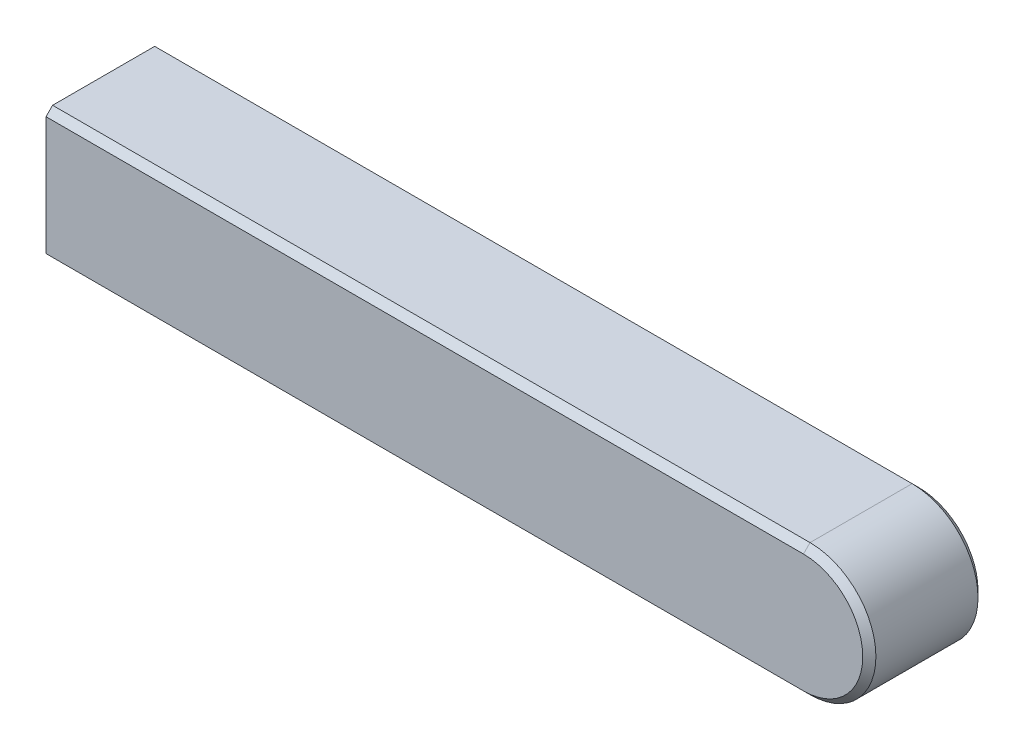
ISO-10303-21;
HEADER;
FILE_DESCRIPTION(('STEP AP214'),'2;1');
FILE_NAME('part.step','',(''),(''),'','','');
FILE_SCHEMA(('AUTOMOTIVE_DESIGN { 1 0 10303 214 1 1 1 1 }'));
ENDSEC;
DATA;
#1=APPLICATION_CONTEXT('core data for automotive mechanical design processes');
#2=APPLICATION_PROTOCOL_DEFINITION('international standard','automotive_design',2000,#1);
#3=PRODUCT_CONTEXT('',#1,'mechanical');
#4=PRODUCT('Part','Part','',(#3));
#5=PRODUCT_RELATED_PRODUCT_CATEGORY('part','',(#4));
#6=PRODUCT_DEFINITION_FORMATION('','',#4);
#7=PRODUCT_DEFINITION_CONTEXT('part definition',#1,'design');
#8=PRODUCT_DEFINITION('design','',#6,#7);
#9=PRODUCT_DEFINITION_SHAPE('','',#8);
#10=(LENGTH_UNIT() NAMED_UNIT(*) SI_UNIT(.MILLI.,.METRE.));
#11=(NAMED_UNIT(*) PLANE_ANGLE_UNIT() SI_UNIT($,.RADIAN.));
#12=(NAMED_UNIT(*) SI_UNIT($,.STERADIAN.) SOLID_ANGLE_UNIT());
#13=UNCERTAINTY_MEASURE_WITH_UNIT(LENGTH_MEASURE(1.E-05),#10,'distance_accuracy_value','');
#14=(GEOMETRIC_REPRESENTATION_CONTEXT(3) GLOBAL_UNCERTAINTY_ASSIGNED_CONTEXT((#13)) GLOBAL_UNIT_ASSIGNED_CONTEXT((#10,
#11,#12)) REPRESENTATION_CONTEXT('',''));
#15=CARTESIAN_POINT('',(0.,0.,0.));
#16=DIRECTION('',(0.,0.,1.));
#17=DIRECTION('',(1.,0.,0.));
#18=AXIS2_PLACEMENT_3D('',#15,#16,#17);
#19=CARTESIAN_POINT('',(0.,0.,7.));
#20=DIRECTION('',(1.,0.,0.));
#21=DIRECTION('',(0.,0.,-1.));
#22=AXIS2_PLACEMENT_3D('',#19,#20,#21);
#23=PLANE('',#22);
#24=DIRECTION('',(0.,-1.,0.));
#25=VECTOR('',#24,1.);
#26=CARTESIAN_POINT('',(0.,0.,0.));
#27=LINE('',#26,#25);
#28=CARTESIAN_POINT('',(0.,7.6,0.));
#29=VERTEX_POINT('',#28);
#30=CARTESIAN_POINT('',(0.,0.399999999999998,0.));
#31=VERTEX_POINT('',#30);
#32=EDGE_CURVE('E133',#29,#31,#27,.T.);
#33=ORIENTED_EDGE('',*,*,#32,.T.);
#34=DIRECTION('',(0.,-0.707106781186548,0.707106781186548));
#35=VECTOR('',#34,1.);
#36=CARTESIAN_POINT('',(0.,0.,0.399999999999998));
#37=LINE('',#36,#35);
#38=CARTESIAN_POINT('',(0.,0.,0.4));
#39=VERTEX_POINT('',#38);
#40=EDGE_CURVE('E111',#31,#39,#37,.T.);
#41=ORIENTED_EDGE('',*,*,#40,.T.);
#42=DIRECTION('',(0.,0.,-1.));
#43=VECTOR('',#42,1.);
#44=CARTESIAN_POINT('',(0.,0.,7.));
#45=LINE('',#44,#43);
#46=CARTESIAN_POINT('',(0.,0.,6.6));
#47=VERTEX_POINT('',#46);
#48=EDGE_CURVE('E121',#47,#39,#45,.T.);
#49=ORIENTED_EDGE('',*,*,#48,.F.);
#50=DIRECTION('',(0.,-0.707106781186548,-0.707106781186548));
#51=VECTOR('',#50,1.);
#52=CARTESIAN_POINT('',(0.,0.399999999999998,7.));
#53=LINE('',#52,#51);
#54=CARTESIAN_POINT('',(0.,0.399999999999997,7.));
#55=VERTEX_POINT('',#54);
#56=EDGE_CURVE('E125',#47,#55,#53,.F.);
#57=ORIENTED_EDGE('',*,*,#56,.T.);
#58=DIRECTION('',(0.,-1.,0.));
#59=VECTOR('',#58,1.);
#60=CARTESIAN_POINT('',(0.,0.,7.));
#61=LINE('',#60,#59);
#62=CARTESIAN_POINT('',(0.,7.6,7.));
#63=VERTEX_POINT('',#62);
#64=EDGE_CURVE('E161',#63,#55,#61,.T.);
#65=ORIENTED_EDGE('',*,*,#64,.F.);
#66=DIRECTION('',(0.,-0.707106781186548,0.707106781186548));
#67=VECTOR('',#66,1.);
#68=CARTESIAN_POINT('',(0.,7.6,7.));
#69=LINE('',#68,#67);
#70=CARTESIAN_POINT('',(0.,8.,6.6));
#71=VERTEX_POINT('',#70);
#72=EDGE_CURVE('E147',#63,#71,#69,.F.);
#73=ORIENTED_EDGE('',*,*,#72,.T.);
#74=DIRECTION('',(0.,0.,-1.));
#75=VECTOR('',#74,1.);
#76=CARTESIAN_POINT('',(0.,8.,7.));
#77=LINE('',#76,#75);
#78=CARTESIAN_POINT('',(0.,8.,0.4));
#79=VERTEX_POINT('',#78);
#80=EDGE_CURVE('E158',#71,#79,#77,.T.);
#81=ORIENTED_EDGE('',*,*,#80,.T.);
#82=DIRECTION('',(0.,-0.707106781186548,-0.707106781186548));
#83=VECTOR('',#82,1.);
#84=CARTESIAN_POINT('',(0.,8.,0.399999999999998));
#85=LINE('',#84,#83);
#86=EDGE_CURVE('E144',#79,#29,#85,.T.);
#87=ORIENTED_EDGE('',*,*,#86,.T.);
#88=EDGE_LOOP('',(#33,#41,#49,#57,#65,#73,#81,#87));
#89=FACE_BOUND('',#88,.T.);
#90=ADVANCED_FACE('F33',(#89),#23,.F.);
#91=CARTESIAN_POINT('',(0.,0.,7.));
#92=DIRECTION('',(0.,1.,0.));
#93=DIRECTION('',(0.,0.,1.));
#94=AXIS2_PLACEMENT_3D('',#91,#92,#93);
#95=PLANE('',#94);
#96=ORIENTED_EDGE('',*,*,#48,.T.);
#97=DIRECTION('',(1.,0.,0.));
#98=VECTOR('',#97,1.);
#99=CARTESIAN_POINT('',(46.,0.,0.399999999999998));
#100=LINE('',#99,#98);
#101=CARTESIAN_POINT('',(46.,0.,0.399999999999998));
#102=VERTEX_POINT('',#101);
#103=EDGE_CURVE('E120',#39,#102,#100,.T.);
#104=ORIENTED_EDGE('',*,*,#103,.T.);
#105=DIRECTION('',(0.,0.,-1.));
#106=VECTOR('',#105,1.);
#107=CARTESIAN_POINT('',(46.,0.,7.));
#108=LINE('',#107,#106);
#109=CARTESIAN_POINT('',(46.,0.,6.6));
#110=VERTEX_POINT('',#109);
#111=EDGE_CURVE('E104',#110,#102,#108,.T.);
#112=ORIENTED_EDGE('',*,*,#111,.F.);
#113=DIRECTION('',(-1.,0.,0.));
#114=VECTOR('',#113,1.);
#115=CARTESIAN_POINT('',(0.,0.,6.6));
#116=LINE('',#115,#114);
#117=EDGE_CURVE('E117',#110,#47,#116,.T.);
#118=ORIENTED_EDGE('',*,*,#117,.T.);
#119=EDGE_LOOP('',(#96,#104,#112,#118));
#120=FACE_BOUND('',#119,.T.);
#121=ADVANCED_FACE('F116',(#120),#95,.F.);
#122=CARTESIAN_POINT('',(46.,4.,7.));
#123=DIRECTION('',(0.,0.,-1.));
#124=DIRECTION('',(-1.,0.,0.));
#125=AXIS2_PLACEMENT_3D('',#122,#123,#124);
#126=CYLINDRICAL_SURFACE('',#125,4.);
#127=ORIENTED_EDGE('',*,*,#111,.T.);
#128=CARTESIAN_POINT('',(46.,4.,0.399999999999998));
#129=DIRECTION('',(0.,0.,-1.));
#130=DIRECTION('',(-1.,0.,0.));
#131=AXIS2_PLACEMENT_3D('',#128,#129,#130);
#132=CIRCLE('',#131,4.);
#133=CARTESIAN_POINT('',(46.,8.,0.399999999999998));
#134=VERTEX_POINT('',#133);
#135=EDGE_CURVE('E110',#102,#134,#132,.F.);
#136=ORIENTED_EDGE('',*,*,#135,.T.);
#137=DIRECTION('',(0.,0.,-1.));
#138=VECTOR('',#137,1.);
#139=CARTESIAN_POINT('',(46.,8.,7.));
#140=LINE('',#139,#138);
#141=CARTESIAN_POINT('',(46.,8.,6.6));
#142=VERTEX_POINT('',#141);
#143=EDGE_CURVE('E106',#142,#134,#140,.T.);
#144=ORIENTED_EDGE('',*,*,#143,.F.);
#145=CARTESIAN_POINT('',(46.,4.,6.6));
#146=DIRECTION('',(0.,0.,-1.));
#147=DIRECTION('',(-1.,0.,0.));
#148=AXIS2_PLACEMENT_3D('',#145,#146,#147);
#149=CIRCLE('',#148,4.);
#150=EDGE_CURVE('E101',#142,#110,#149,.T.);
#151=ORIENTED_EDGE('',*,*,#150,.T.);
#152=EDGE_LOOP('',(#127,#136,#144,#151));
#153=FACE_BOUND('',#152,.T.);
#154=ADVANCED_FACE('F103',(#153),#126,.T.);
#155=CARTESIAN_POINT('',(0.,8.,7.));
#156=DIRECTION('',(0.,-1.,0.));
#157=DIRECTION('',(0.,0.,-1.));
#158=AXIS2_PLACEMENT_3D('',#155,#156,#157);
#159=PLANE('',#158);
#160=ORIENTED_EDGE('',*,*,#143,.T.);
#161=DIRECTION('',(-1.,0.,0.));
#162=VECTOR('',#161,1.);
#163=CARTESIAN_POINT('',(0.,8.,0.399999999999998));
#164=LINE('',#163,#162);
#165=EDGE_CURVE('E138',#134,#79,#164,.T.);
#166=ORIENTED_EDGE('',*,*,#165,.T.);
#167=ORIENTED_EDGE('',*,*,#80,.F.);
#168=DIRECTION('',(1.,0.,0.));
#169=VECTOR('',#168,1.);
#170=CARTESIAN_POINT('',(0.,8.,6.6));
#171=LINE('',#170,#169);
#172=EDGE_CURVE('E140',#71,#142,#171,.T.);
#173=ORIENTED_EDGE('',*,*,#172,.T.);
#174=EDGE_LOOP('',(#160,#166,#167,#173));
#175=FACE_BOUND('',#174,.T.);
#176=ADVANCED_FACE('F173',(#175),#159,.F.);
#177=CARTESIAN_POINT('',(46.,4.,7.));
#178=DIRECTION('',(0.,0.,-1.));
#179=DIRECTION('',(-1.,0.,0.));
#180=AXIS2_PLACEMENT_3D('',#177,#178,#179);
#181=PLANE('',#180);
#182=ORIENTED_EDGE('',*,*,#64,.T.);
#183=DIRECTION('',(1.,0.,0.));
#184=VECTOR('',#183,1.);
#185=CARTESIAN_POINT('',(46.,0.399999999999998,7.));
#186=LINE('',#185,#184);
#187=CARTESIAN_POINT('',(46.,0.399999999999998,7.));
#188=VERTEX_POINT('',#187);
#189=EDGE_CURVE('E11',#55,#188,#186,.T.);
#190=ORIENTED_EDGE('',*,*,#189,.T.);
#191=CARTESIAN_POINT('',(46.,4.,7.));
#192=DIRECTION('',(0.,0.,-1.));
#193=DIRECTION('',(-1.,0.,0.));
#194=AXIS2_PLACEMENT_3D('',#191,#192,#193);
#195=CIRCLE('',#194,3.6);
#196=CARTESIAN_POINT('',(46.,7.6,7.));
#197=VERTEX_POINT('',#196);
#198=EDGE_CURVE('E42',#188,#197,#195,.F.);
#199=ORIENTED_EDGE('',*,*,#198,.T.);
#200=DIRECTION('',(-1.,0.,0.));
#201=VECTOR('',#200,1.);
#202=CARTESIAN_POINT('',(46.,7.6,7.));
#203=LINE('',#202,#201);
#204=EDGE_CURVE('E136',#197,#63,#203,.T.);
#205=ORIENTED_EDGE('',*,*,#204,.T.);
#206=EDGE_LOOP('',(#182,#190,#199,#205));
#207=FACE_BOUND('',#206,.T.);
#208=ADVANCED_FACE('F166',(#207),#181,.F.);
#209=CARTESIAN_POINT('',(46.,4.,0.));
#210=DIRECTION('',(0.,0.,-1.));
#211=DIRECTION('',(-1.,0.,0.));
#212=AXIS2_PLACEMENT_3D('',#209,#210,#211);
#213=PLANE('',#212);
#214=CARTESIAN_POINT('',(46.,4.,0.));
#215=DIRECTION('',(0.,0.,-1.));
#216=DIRECTION('',(-1.,0.,0.));
#217=AXIS2_PLACEMENT_3D('',#214,#215,#216);
#218=CIRCLE('',#217,3.6);
#219=CARTESIAN_POINT('',(46.,7.6,0.));
#220=VERTEX_POINT('',#219);
#221=CARTESIAN_POINT('',(46.,0.399999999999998,0.));
#222=VERTEX_POINT('',#221);
#223=EDGE_CURVE('E151',#220,#222,#218,.T.);
#224=ORIENTED_EDGE('',*,*,#223,.T.);
#225=DIRECTION('',(-1.,0.,0.));
#226=VECTOR('',#225,1.);
#227=CARTESIAN_POINT('',(0.,0.399999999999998,0.));
#228=LINE('',#227,#226);
#229=EDGE_CURVE('E149',#222,#31,#228,.T.);
#230=ORIENTED_EDGE('',*,*,#229,.T.);
#231=ORIENTED_EDGE('',*,*,#32,.F.);
#232=DIRECTION('',(1.,0.,0.));
#233=VECTOR('',#232,1.);
#234=CARTESIAN_POINT('',(46.,7.6,0.));
#235=LINE('',#234,#233);
#236=EDGE_CURVE('E153',#29,#220,#235,.T.);
#237=ORIENTED_EDGE('',*,*,#236,.T.);
#238=EDGE_LOOP('',(#224,#230,#231,#237));
#239=FACE_BOUND('',#238,.T.);
#240=ADVANCED_FACE('F183',(#239),#213,.T.);
#241=CARTESIAN_POINT('',(0.,8.,0.399999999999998));
#242=DIRECTION('',(0.,0.707106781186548,-0.707106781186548));
#243=DIRECTION('',(0.,0.707106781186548,0.707106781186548));
#244=AXIS2_PLACEMENT_3D('',#241,#242,#243);
#245=PLANE('',#244);
#246=ORIENTED_EDGE('',*,*,#86,.F.);
#247=ORIENTED_EDGE('',*,*,#165,.F.);
#248=DIRECTION('',(0.,0.707106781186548,0.707106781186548));
#249=VECTOR('',#248,1.);
#250=CARTESIAN_POINT('',(46.,7.6,0.));
#251=LINE('',#250,#249);
#252=EDGE_CURVE('E130',#220,#134,#251,.T.);
#253=ORIENTED_EDGE('',*,*,#252,.F.);
#254=ORIENTED_EDGE('',*,*,#236,.F.);
#255=EDGE_LOOP('',(#246,#247,#253,#254));
#256=FACE_BOUND('',#255,.T.);
#257=ADVANCED_FACE('F179',(#256),#245,.T.);
#258=CARTESIAN_POINT('',(46.,4.,0.399999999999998));
#259=DIRECTION('',(0.,0.,1.));
#260=DIRECTION('',(1.,0.,0.));
#261=AXIS2_PLACEMENT_3D('',#258,#259,#260);
#262=CONICAL_SURFACE('',#261,4.,0.785398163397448);
#263=ORIENTED_EDGE('',*,*,#252,.T.);
#264=ORIENTED_EDGE('',*,*,#135,.F.);
#265=DIRECTION('',(0.,-0.707106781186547,0.707106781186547));
#266=VECTOR('',#265,1.);
#267=CARTESIAN_POINT('',(46.,0.399999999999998,0.));
#268=LINE('',#267,#266);
#269=EDGE_CURVE('E128',#222,#102,#268,.T.);
#270=ORIENTED_EDGE('',*,*,#269,.F.);
#271=ORIENTED_EDGE('',*,*,#223,.F.);
#272=EDGE_LOOP('',(#263,#264,#270,#271));
#273=FACE_BOUND('',#272,.T.);
#274=ADVANCED_FACE('F191',(#273),#262,.T.);
#275=CARTESIAN_POINT('',(0.,0.,0.399999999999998));
#276=DIRECTION('',(0.,-0.707106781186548,-0.707106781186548));
#277=DIRECTION('',(0.,0.707106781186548,-0.707106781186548));
#278=AXIS2_PLACEMENT_3D('',#275,#276,#277);
#279=PLANE('',#278);
#280=ORIENTED_EDGE('',*,*,#40,.F.);
#281=ORIENTED_EDGE('',*,*,#229,.F.);
#282=ORIENTED_EDGE('',*,*,#269,.T.);
#283=ORIENTED_EDGE('',*,*,#103,.F.);
#284=EDGE_LOOP('',(#280,#281,#282,#283));
#285=FACE_BOUND('',#284,.T.);
#286=ADVANCED_FACE('F187',(#285),#279,.T.);
#287=CARTESIAN_POINT('',(46.,7.6,7.));
#288=DIRECTION('',(0.,-0.707106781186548,-0.707106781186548));
#289=DIRECTION('',(0.,0.707106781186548,-0.707106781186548));
#290=AXIS2_PLACEMENT_3D('',#287,#288,#289);
#291=PLANE('',#290);
#292=ORIENTED_EDGE('',*,*,#72,.F.);
#293=ORIENTED_EDGE('',*,*,#204,.F.);
#294=DIRECTION('',(0.,-0.707106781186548,0.707106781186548));
#295=VECTOR('',#294,1.);
#296=CARTESIAN_POINT('',(46.,8.,6.6));
#297=LINE('',#296,#295);
#298=EDGE_CURVE('E37',#142,#197,#297,.T.);
#299=ORIENTED_EDGE('',*,*,#298,.F.);
#300=ORIENTED_EDGE('',*,*,#172,.F.);
#301=EDGE_LOOP('',(#292,#293,#299,#300));
#302=FACE_BOUND('',#301,.T.);
#303=ADVANCED_FACE('F35',(#302),#291,.F.);
#304=CARTESIAN_POINT('',(46.,4.,7.));
#305=DIRECTION('',(0.,0.,-1.));
#306=DIRECTION('',(-1.,0.,0.));
#307=AXIS2_PLACEMENT_3D('',#304,#305,#306);
#308=CONICAL_SURFACE('',#307,3.6,0.785398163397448);
#309=ORIENTED_EDGE('',*,*,#298,.T.);
#310=ORIENTED_EDGE('',*,*,#198,.F.);
#311=DIRECTION('',(0.,0.707106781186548,0.707106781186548));
#312=VECTOR('',#311,1.);
#313=CARTESIAN_POINT('',(46.,0.,6.6));
#314=LINE('',#313,#312);
#315=EDGE_CURVE('E50',#110,#188,#314,.T.);
#316=ORIENTED_EDGE('',*,*,#315,.F.);
#317=ORIENTED_EDGE('',*,*,#150,.F.);
#318=EDGE_LOOP('',(#309,#310,#316,#317));
#319=FACE_BOUND('',#318,.T.);
#320=ADVANCED_FACE('F127',(#319),#308,.T.);
#321=CARTESIAN_POINT('',(46.,0.399999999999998,7.));
#322=DIRECTION('',(0.,0.707106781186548,-0.707106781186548));
#323=DIRECTION('',(0.,0.707106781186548,0.707106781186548));
#324=AXIS2_PLACEMENT_3D('',#321,#322,#323);
#325=PLANE('',#324);
#326=ORIENTED_EDGE('',*,*,#56,.F.);
#327=ORIENTED_EDGE('',*,*,#117,.F.);
#328=ORIENTED_EDGE('',*,*,#315,.T.);
#329=ORIENTED_EDGE('',*,*,#189,.F.);
#330=EDGE_LOOP('',(#326,#327,#328,#329));
#331=FACE_BOUND('',#330,.T.);
#332=ADVANCED_FACE('F124',(#331),#325,.F.);
#333=CLOSED_SHELL('',(#90,#121,#154,#176,#208,#240,#257,#274,#286,#303,#320,#332));
#334=MANIFOLD_SOLID_BREP('B2',#333);
#335=ADVANCED_BREP_SHAPE_REPRESENTATION('',(#18,#334),#14);
#336=SHAPE_DEFINITION_REPRESENTATION(#9,#335);
ENDSEC;
END-ISO-10303-21;
